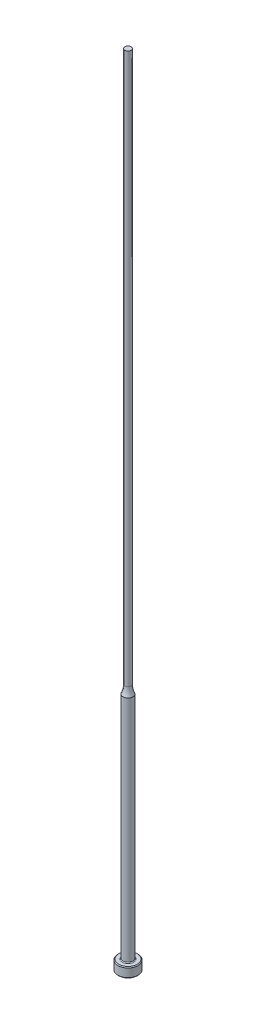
from build123d import *

# Parameters (mm, degrees)
CHAMFER1_SIZE = 0.254
FILLET1_R     = 0.254


with BuildPart() as part:
    # Sketch1 → Revolve1 (revolve)
    with BuildSketch(Plane.XY, mode=Mode.PRIVATE) as revolve1_sk:
        with BuildLine():
            Line((0, 0), (-3.175, 0))
            Line((-3.175, 0), (-3.175, 3.175))
            Line((-3.175, 3.175), (-1.5875, 3.175))
            Line((-1.5875, 3.175), (-1.5875, 76.2))
            ThreePointArc((-1.5875, 76.2), (-1.142565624, 77.509911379), (-0.99187, 78.885093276))
            Line((-0.99187, 78.885093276), (-0.99187, 254))
            Line((-0.99187, 254), (0, 254))
            Line((0, 254), (0, 0))
        make_face()
    revolve(revolve1_sk.sketch.rotate(Axis((0, 259.958771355, 0), (0, -1, 0)), 270), axis=Axis((0, 259.958771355, 0), (0, -1, 0)))

    # Chamfer1
    chamfer1_edges = [part.edges().sort_by_distance(p)[0] for p in [
        (0, 0, -3.175),
        (0, 3.175, -3.175),
    ]]
    chamfer(chamfer1_edges, length=CHAMFER1_SIZE)

    # Fillet1
    fillet1_edges = [part.edges().sort_by_distance(p)[0] for p in [
        (0, 3.175, -1.5875),
    ]]
    fillet(fillet1_edges, radius=FILLET1_R)


solid = part.part
